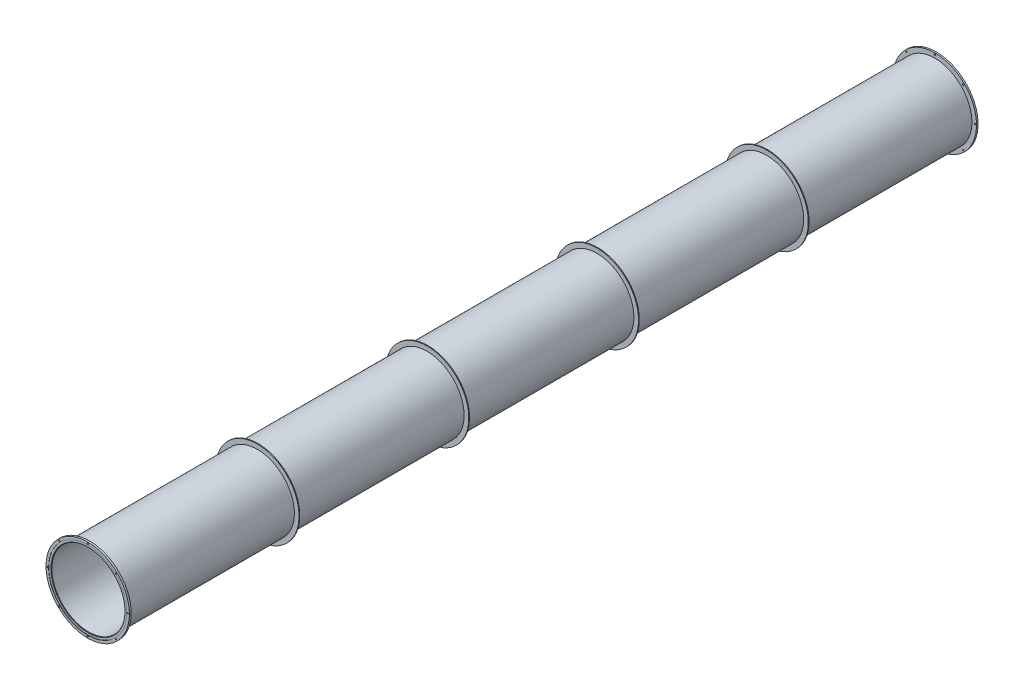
ISO-10303-21;
HEADER;
FILE_DESCRIPTION(('STEP AP214'),'2;1');
FILE_NAME('part.step','',(''),(''),'','','');
FILE_SCHEMA(('AUTOMOTIVE_DESIGN { 1 0 10303 214 1 1 1 1 }'));
ENDSEC;
DATA;
#1=APPLICATION_CONTEXT('core data for automotive mechanical design processes');
#2=APPLICATION_PROTOCOL_DEFINITION('international standard','automotive_design',2000,#1);
#3=PRODUCT_CONTEXT('',#1,'mechanical');
#4=PRODUCT('Part','Part','',(#3));
#5=PRODUCT_RELATED_PRODUCT_CATEGORY('part','',(#4));
#6=PRODUCT_DEFINITION_FORMATION('','',#4);
#7=PRODUCT_DEFINITION_CONTEXT('part definition',#1,'design');
#8=PRODUCT_DEFINITION('design','',#6,#7);
#9=PRODUCT_DEFINITION_SHAPE('','',#8);
#10=(LENGTH_UNIT() NAMED_UNIT(*) SI_UNIT(.MILLI.,.METRE.));
#11=(NAMED_UNIT(*) PLANE_ANGLE_UNIT() SI_UNIT($,.RADIAN.));
#12=(NAMED_UNIT(*) SI_UNIT($,.STERADIAN.) SOLID_ANGLE_UNIT());
#13=UNCERTAINTY_MEASURE_WITH_UNIT(LENGTH_MEASURE(1.E-05),#10,'distance_accuracy_value','');
#14=(GEOMETRIC_REPRESENTATION_CONTEXT(3) GLOBAL_UNCERTAINTY_ASSIGNED_CONTEXT((#13)) GLOBAL_UNIT_ASSIGNED_CONTEXT((#10,
#11,#12)) REPRESENTATION_CONTEXT('',''));
#15=CARTESIAN_POINT('',(0.,0.,0.));
#16=DIRECTION('',(0.,0.,1.));
#17=DIRECTION('',(1.,0.,0.));
#18=AXIS2_PLACEMENT_3D('',#15,#16,#17);
#19=CARTESIAN_POINT('',(685.8,0.,-6978.65));
#20=DIRECTION('',(0.,0.,1.));
#21=DIRECTION('',(1.,0.,0.));
#22=AXIS2_PLACEMENT_3D('',#19,#20,#21);
#23=PLANE('',#22);
#24=CARTESIAN_POINT('',(-466.973318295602,466.97331829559,-6978.65));
#25=DIRECTION('',(0.,0.,-1.));
#26=DIRECTION('',(-1.,0.,0.));
#27=AXIS2_PLACEMENT_3D('',#24,#25,#26);
#28=CIRCLE('',#27,11.1125);
#29=CARTESIAN_POINT('',(-478.085818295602,466.97331829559,-6978.65));
#30=VERTEX_POINT('',#29);
#31=EDGE_CURVE('E239',#30,#30,#28,.T.);
#32=ORIENTED_EDGE('',*,*,#31,.F.);
#33=EDGE_LOOP('',(#32));
#34=FACE_BOUND('',#33,.T.);
#35=CARTESIAN_POINT('',(-6.91732282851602E-12,660.4,-6978.65));
#36=DIRECTION('',(0.,0.,-1.));
#37=DIRECTION('',(-1.,0.,0.));
#38=AXIS2_PLACEMENT_3D('',#35,#36,#37);
#39=CIRCLE('',#38,11.1125);
#40=CARTESIAN_POINT('',(-11.1125000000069,660.4,-6978.65));
#41=VERTEX_POINT('',#40);
#42=EDGE_CURVE('E233',#41,#41,#39,.T.);
#43=ORIENTED_EDGE('',*,*,#42,.F.);
#44=EDGE_LOOP('',(#43));
#45=FACE_BOUND('',#44,.T.);
#46=CARTESIAN_POINT('',(466.973318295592,466.9733182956,-6978.65));
#47=DIRECTION('',(0.,0.,-1.));
#48=DIRECTION('',(-1.,0.,0.));
#49=AXIS2_PLACEMENT_3D('',#46,#47,#48);
#50=CIRCLE('',#49,11.1125);
#51=CARTESIAN_POINT('',(455.860818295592,466.9733182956,-6978.65));
#52=VERTEX_POINT('',#51);
#53=EDGE_CURVE('E227',#52,#52,#50,.T.);
#54=ORIENTED_EDGE('',*,*,#53,.F.);
#55=EDGE_LOOP('',(#54));
#56=FACE_BOUND('',#55,.T.);
#57=CARTESIAN_POINT('',(660.4,0.,-6978.65));
#58=DIRECTION('',(0.,0.,-1.));
#59=DIRECTION('',(-1.,0.,0.));
#60=AXIS2_PLACEMENT_3D('',#57,#58,#59);
#61=CIRCLE('',#60,11.1125);
#62=CARTESIAN_POINT('',(649.2875,0.,-6978.65));
#63=VERTEX_POINT('',#62);
#64=EDGE_CURVE('E221',#63,#63,#61,.T.);
#65=ORIENTED_EDGE('',*,*,#64,.F.);
#66=EDGE_LOOP('',(#65));
#67=FACE_BOUND('',#66,.T.);
#68=CARTESIAN_POINT('',(466.973318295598,-466.973318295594,-6978.65));
#69=DIRECTION('',(0.,0.,-1.));
#70=DIRECTION('',(-1.,0.,0.));
#71=AXIS2_PLACEMENT_3D('',#68,#69,#70);
#72=CIRCLE('',#71,11.1125);
#73=CARTESIAN_POINT('',(455.860818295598,-466.973318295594,-6978.65));
#74=VERTEX_POINT('',#73);
#75=EDGE_CURVE('E215',#74,#74,#72,.T.);
#76=ORIENTED_EDGE('',*,*,#75,.F.);
#77=EDGE_LOOP('',(#76));
#78=FACE_BOUND('',#77,.T.);
#79=CARTESIAN_POINT('',(2.30577427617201E-12,-660.4,-6978.65));
#80=DIRECTION('',(0.,0.,-1.));
#81=DIRECTION('',(-1.,0.,0.));
#82=AXIS2_PLACEMENT_3D('',#79,#80,#81);
#83=CIRCLE('',#82,11.1125);
#84=CARTESIAN_POINT('',(-11.1124999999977,-660.4,-6978.65));
#85=VERTEX_POINT('',#84);
#86=EDGE_CURVE('E209',#85,#85,#83,.T.);
#87=ORIENTED_EDGE('',*,*,#86,.F.);
#88=EDGE_LOOP('',(#87));
#89=FACE_BOUND('',#88,.T.);
#90=CARTESIAN_POINT('',(-466.973318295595,-466.973318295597,-6978.65));
#91=DIRECTION('',(0.,0.,-1.));
#92=DIRECTION('',(-1.,0.,0.));
#93=AXIS2_PLACEMENT_3D('',#90,#91,#92);
#94=CIRCLE('',#93,11.1125);
#95=CARTESIAN_POINT('',(-478.085818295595,-466.973318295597,-6978.65));
#96=VERTEX_POINT('',#95);
#97=EDGE_CURVE('E203',#96,#96,#94,.T.);
#98=ORIENTED_EDGE('',*,*,#97,.F.);
#99=EDGE_LOOP('',(#98));
#100=FACE_BOUND('',#99,.T.);
#101=CARTESIAN_POINT('',(0.,0.,-6978.65));
#102=DIRECTION('',(0.,0.,-1.));
#103=DIRECTION('',(-1.,0.,0.));
#104=AXIS2_PLACEMENT_3D('',#101,#102,#103);
#105=CIRCLE('',#104,685.8);
#106=CARTESIAN_POINT('',(-685.8,0.,-6978.65));
#107=VERTEX_POINT('',#106);
#108=EDGE_CURVE('E113',#107,#107,#105,.T.);
#109=ORIENTED_EDGE('',*,*,#108,.T.);
#110=EDGE_LOOP('',(#109));
#111=FACE_BOUND('',#110,.T.);
#112=CARTESIAN_POINT('',(0.,0.,-6978.65));
#113=DIRECTION('',(0.,0.,-1.));
#114=DIRECTION('',(-1.,0.,0.));
#115=AXIS2_PLACEMENT_3D('',#112,#113,#114);
#116=CIRCLE('',#115,641.35);
#117=CARTESIAN_POINT('',(-641.35,0.,-6978.65));
#118=VERTEX_POINT('',#117);
#119=EDGE_CURVE('E116',#118,#118,#116,.T.);
#120=ORIENTED_EDGE('',*,*,#119,.F.);
#121=EDGE_LOOP('',(#120));
#122=FACE_BOUND('',#121,.T.);
#123=CARTESIAN_POINT('',(-660.4,0.,-6978.65));
#124=DIRECTION('',(0.,0.,-1.));
#125=DIRECTION('',(-1.,0.,0.));
#126=AXIS2_PLACEMENT_3D('',#123,#124,#125);
#127=CIRCLE('',#126,11.1125);
#128=CARTESIAN_POINT('',(-671.5125,0.,-6978.65));
#129=VERTEX_POINT('',#128);
#130=EDGE_CURVE('E197',#129,#129,#127,.T.);
#131=ORIENTED_EDGE('',*,*,#130,.F.);
#132=EDGE_LOOP('',(#131));
#133=FACE_BOUND('',#132,.T.);
#134=ADVANCED_FACE('F30',(#34,#45,#56,#67,#78,#89,#100,#111,#122,#133),#23,.F.);
#135=CARTESIAN_POINT('',(685.800000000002,0.,6989.7625));
#136=DIRECTION('',(0.,0.,-1.));
#137=DIRECTION('',(-1.,0.,0.));
#138=AXIS2_PLACEMENT_3D('',#135,#136,#137);
#139=PLANE('',#138);
#140=CARTESIAN_POINT('',(-6.99819850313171E-12,660.4,6989.7625));
#141=DIRECTION('',(0.,0.,1.));
#142=DIRECTION('',(1.,0.,0.));
#143=AXIS2_PLACEMENT_3D('',#140,#141,#142);
#144=CIRCLE('',#143,11.1125);
#145=CARTESIAN_POINT('',(11.112499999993,660.4,6989.7625));
#146=VERTEX_POINT('',#145);
#147=EDGE_CURVE('E185',#146,#146,#144,.T.);
#148=ORIENTED_EDGE('',*,*,#147,.F.);
#149=EDGE_LOOP('',(#148));
#150=FACE_BOUND('',#149,.T.);
#151=CARTESIAN_POINT('',(-466.973318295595,-466.973318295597,6989.7625));
#152=DIRECTION('',(0.,0.,1.));
#153=DIRECTION('',(1.,0.,0.));
#154=AXIS2_PLACEMENT_3D('',#151,#152,#153);
#155=CIRCLE('',#154,11.1125);
#156=CARTESIAN_POINT('',(-455.860818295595,-466.973318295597,6989.7625));
#157=VERTEX_POINT('',#156);
#158=EDGE_CURVE('E155',#157,#157,#155,.T.);
#159=ORIENTED_EDGE('',*,*,#158,.F.);
#160=EDGE_LOOP('',(#159));
#161=FACE_BOUND('',#160,.T.);
#162=CARTESIAN_POINT('',(-660.4,0.,6989.7625));
#163=DIRECTION('',(0.,0.,1.));
#164=DIRECTION('',(1.,0.,0.));
#165=AXIS2_PLACEMENT_3D('',#162,#163,#164);
#166=CIRCLE('',#165,11.1125);
#167=CARTESIAN_POINT('',(-649.2875,0.,6989.7625));
#168=VERTEX_POINT('',#167);
#169=EDGE_CURVE('E149',#168,#168,#166,.T.);
#170=ORIENTED_EDGE('',*,*,#169,.F.);
#171=EDGE_LOOP('',(#170));
#172=FACE_BOUND('',#171,.T.);
#173=CARTESIAN_POINT('',(0.,0.,6989.7625));
#174=DIRECTION('',(0.,0.,-1.));
#175=DIRECTION('',(-1.,0.,0.));
#176=AXIS2_PLACEMENT_3D('',#173,#174,#175);
#177=CIRCLE('',#176,685.800000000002);
#178=CARTESIAN_POINT('',(-685.800000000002,0.,6989.7625));
#179=VERTEX_POINT('',#178);
#180=EDGE_CURVE('E50',#179,#179,#177,.T.);
#181=ORIENTED_EDGE('',*,*,#180,.F.);
#182=EDGE_LOOP('',(#181));
#183=FACE_BOUND('',#182,.T.);
#184=CARTESIAN_POINT('',(0.,0.,6989.7625));
#185=DIRECTION('',(0.,0.,-1.));
#186=DIRECTION('',(-1.,0.,0.));
#187=AXIS2_PLACEMENT_3D('',#184,#185,#186);
#188=CIRCLE('',#187,642.937500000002);
#189=CARTESIAN_POINT('',(-642.937500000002,0.,6989.7625));
#190=VERTEX_POINT('',#189);
#191=EDGE_CURVE('E45',#190,#190,#188,.T.);
#192=ORIENTED_EDGE('',*,*,#191,.T.);
#193=EDGE_LOOP('',(#192));
#194=FACE_BOUND('',#193,.T.);
#195=CARTESIAN_POINT('',(2.3866499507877E-12,-660.4,6989.7625));
#196=DIRECTION('',(0.,0.,1.));
#197=DIRECTION('',(1.,0.,0.));
#198=AXIS2_PLACEMENT_3D('',#195,#196,#197);
#199=CIRCLE('',#198,11.1125);
#200=CARTESIAN_POINT('',(11.1125000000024,-660.4,6989.7625));
#201=VERTEX_POINT('',#200);
#202=EDGE_CURVE('E161',#201,#201,#199,.T.);
#203=ORIENTED_EDGE('',*,*,#202,.F.);
#204=EDGE_LOOP('',(#203));
#205=FACE_BOUND('',#204,.T.);
#206=CARTESIAN_POINT('',(466.973318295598,-466.973318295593,6989.7625));
#207=DIRECTION('',(0.,0.,1.));
#208=DIRECTION('',(1.,0.,0.));
#209=AXIS2_PLACEMENT_3D('',#206,#207,#208);
#210=CIRCLE('',#209,11.1125);
#211=CARTESIAN_POINT('',(478.085818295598,-466.973318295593,6989.7625));
#212=VERTEX_POINT('',#211);
#213=EDGE_CURVE('E167',#212,#212,#210,.T.);
#214=ORIENTED_EDGE('',*,*,#213,.F.);
#215=EDGE_LOOP('',(#214));
#216=FACE_BOUND('',#215,.T.);
#217=CARTESIAN_POINT('',(660.4,0.,6989.7625));
#218=DIRECTION('',(0.,0.,1.));
#219=DIRECTION('',(1.,0.,0.));
#220=AXIS2_PLACEMENT_3D('',#217,#218,#219);
#221=CIRCLE('',#220,11.1125);
#222=CARTESIAN_POINT('',(671.5125,0.,6989.7625));
#223=VERTEX_POINT('',#222);
#224=EDGE_CURVE('E173',#223,#223,#221,.T.);
#225=ORIENTED_EDGE('',*,*,#224,.F.);
#226=EDGE_LOOP('',(#225));
#227=FACE_BOUND('',#226,.T.);
#228=CARTESIAN_POINT('',(466.973318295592,466.9733182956,6989.7625));
#229=DIRECTION('',(0.,0.,1.));
#230=DIRECTION('',(1.,0.,0.));
#231=AXIS2_PLACEMENT_3D('',#228,#229,#230);
#232=CIRCLE('',#231,11.1125);
#233=CARTESIAN_POINT('',(478.085818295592,466.9733182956,6989.7625));
#234=VERTEX_POINT('',#233);
#235=EDGE_CURVE('E179',#234,#234,#232,.T.);
#236=ORIENTED_EDGE('',*,*,#235,.F.);
#237=EDGE_LOOP('',(#236));
#238=FACE_BOUND('',#237,.T.);
#239=CARTESIAN_POINT('',(-466.973318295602,466.97331829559,6989.7625));
#240=DIRECTION('',(0.,0.,1.));
#241=DIRECTION('',(1.,0.,0.));
#242=AXIS2_PLACEMENT_3D('',#239,#240,#241);
#243=CIRCLE('',#242,11.1125);
#244=CARTESIAN_POINT('',(-455.860818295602,466.97331829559,6989.7625));
#245=VERTEX_POINT('',#244);
#246=EDGE_CURVE('E191',#245,#245,#243,.T.);
#247=ORIENTED_EDGE('',*,*,#246,.F.);
#248=EDGE_LOOP('',(#247));
#249=FACE_BOUND('',#248,.T.);
#250=ADVANCED_FACE('F247',(#150,#161,#172,#183,#194,#205,#216,#227,#238,#249),#139,.F.);
#251=CARTESIAN_POINT('',(0.,0.,6975.475));
#252=DIRECTION('',(0.,0.,1.));
#253=DIRECTION('',(1.,0.,0.));
#254=AXIS2_PLACEMENT_3D('',#251,#252,#253);
#255=CONICAL_SURFACE('',#254,603.25,0.785398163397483);
#256=CARTESIAN_POINT('',(0.,0.,6981.825));
#257=DIRECTION('',(0.,0.,-1.));
#258=DIRECTION('',(-1.,0.,0.));
#259=AXIS2_PLACEMENT_3D('',#256,#257,#258);
#260=CIRCLE('',#259,609.600000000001);
#261=CARTESIAN_POINT('',(-609.600000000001,0.,6981.825));
#262=VERTEX_POINT('',#261);
#263=EDGE_CURVE('E10',#262,#262,#260,.T.);
#264=ORIENTED_EDGE('',*,*,#263,.F.);
#265=EDGE_LOOP('',(#264));
#266=FACE_BOUND('',#265,.T.);
#267=CARTESIAN_POINT('',(0.,0.,6975.475));
#268=DIRECTION('',(0.,0.,-1.));
#269=DIRECTION('',(-1.,0.,0.));
#270=AXIS2_PLACEMENT_3D('',#267,#268,#269);
#271=CIRCLE('',#270,603.25);
#272=CARTESIAN_POINT('',(-603.25,0.,6975.475));
#273=VERTEX_POINT('',#272);
#274=EDGE_CURVE('E143',#273,#273,#271,.T.);
#275=ORIENTED_EDGE('',*,*,#274,.T.);
#276=EDGE_LOOP('',(#275));
#277=FACE_BOUND('',#276,.T.);
#278=ADVANCED_FACE('F32',(#266,#277),#255,.F.);
#279=CARTESIAN_POINT('',(0.,0.,-88.99));
#280=DIRECTION('',(0.,0.,-1.));
#281=DIRECTION('',(-1.,0.,0.));
#282=AXIS2_PLACEMENT_3D('',#279,#280,#281);
#283=CYLINDRICAL_SURFACE('',#282,609.600000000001);
#284=CARTESIAN_POINT('',(0.,0.,6985.));
#285=DIRECTION('',(0.,0.,-1.));
#286=DIRECTION('',(-1.,0.,0.));
#287=AXIS2_PLACEMENT_3D('',#284,#285,#286);
#288=CIRCLE('',#287,609.600000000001);
#289=CARTESIAN_POINT('',(-609.600000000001,0.,6985.));
#290=VERTEX_POINT('',#289);
#291=EDGE_CURVE('E37',#290,#290,#288,.T.);
#292=ORIENTED_EDGE('',*,*,#291,.F.);
#293=EDGE_LOOP('',(#292));
#294=FACE_BOUND('',#293,.T.);
#295=ORIENTED_EDGE('',*,*,#263,.T.);
#296=EDGE_LOOP('',(#295));
#297=FACE_BOUND('',#296,.T.);
#298=ADVANCED_FACE('F442',(#294,#297),#283,.F.);
#299=CARTESIAN_POINT('',(642.937500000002,0.,6985.));
#300=DIRECTION('',(0.,0.,-1.));
#301=DIRECTION('',(-1.,0.,0.));
#302=AXIS2_PLACEMENT_3D('',#299,#300,#301);
#303=PLANE('',#302);
#304=CARTESIAN_POINT('',(0.,0.,6985.));
#305=DIRECTION('',(0.,0.,-1.));
#306=DIRECTION('',(-1.,0.,0.));
#307=AXIS2_PLACEMENT_3D('',#304,#305,#306);
#308=CIRCLE('',#307,642.937500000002);
#309=CARTESIAN_POINT('',(-642.937500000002,0.,6985.));
#310=VERTEX_POINT('',#309);
#311=EDGE_CURVE('E41',#310,#310,#308,.T.);
#312=ORIENTED_EDGE('',*,*,#311,.F.);
#313=EDGE_LOOP('',(#312));
#314=FACE_BOUND('',#313,.T.);
#315=ORIENTED_EDGE('',*,*,#291,.T.);
#316=EDGE_LOOP('',(#315));
#317=FACE_BOUND('',#316,.T.);
#318=ADVANCED_FACE('F439',(#314,#317),#303,.F.);
#319=CARTESIAN_POINT('',(0.,0.,-88.99));
#320=DIRECTION('',(0.,0.,-1.));
#321=DIRECTION('',(-1.,0.,0.));
#322=AXIS2_PLACEMENT_3D('',#319,#320,#321);
#323=CYLINDRICAL_SURFACE('',#322,642.937500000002);
#324=ORIENTED_EDGE('',*,*,#191,.F.);
#325=EDGE_LOOP('',(#324));
#326=FACE_BOUND('',#325,.T.);
#327=ORIENTED_EDGE('',*,*,#311,.T.);
#328=EDGE_LOOP('',(#327));
#329=FACE_BOUND('',#328,.T.);
#330=ADVANCED_FACE('F432',(#326,#329),#323,.F.);
#331=CARTESIAN_POINT('',(0.,0.,-88.99));
#332=DIRECTION('',(0.,0.,-1.));
#333=DIRECTION('',(-1.,0.,0.));
#334=AXIS2_PLACEMENT_3D('',#331,#332,#333);
#335=CYLINDRICAL_SURFACE('',#334,685.800000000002);
#336=CARTESIAN_POINT('',(0.,0.,6959.6));
#337=DIRECTION('',(0.,0.,-1.));
#338=DIRECTION('',(-1.,0.,0.));
#339=AXIS2_PLACEMENT_3D('',#336,#337,#338);
#340=CIRCLE('',#339,685.800000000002);
#341=CARTESIAN_POINT('',(-685.800000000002,0.,6959.6));
#342=VERTEX_POINT('',#341);
#343=EDGE_CURVE('E53',#342,#342,#340,.T.);
#344=ORIENTED_EDGE('',*,*,#343,.F.);
#345=EDGE_LOOP('',(#344));
#346=FACE_BOUND('',#345,.T.);
#347=ORIENTED_EDGE('',*,*,#180,.T.);
#348=EDGE_LOOP('',(#347));
#349=FACE_BOUND('',#348,.T.);
#350=ADVANCED_FACE('F428',(#346,#349),#335,.T.);
#351=CARTESIAN_POINT('',(609.6,0.,6959.6));
#352=DIRECTION('',(0.,0.,1.));
#353=DIRECTION('',(1.,0.,0.));
#354=AXIS2_PLACEMENT_3D('',#351,#352,#353);
#355=PLANE('',#354);
#356=CARTESIAN_POINT('',(-466.973318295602,466.97331829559,6959.6));
#357=DIRECTION('',(0.,0.,1.));
#358=DIRECTION('',(1.,0.,0.));
#359=AXIS2_PLACEMENT_3D('',#356,#357,#358);
#360=CIRCLE('',#359,11.1124999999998);
#361=CARTESIAN_POINT('',(-455.860818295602,466.97331829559,6959.6));
#362=VERTEX_POINT('',#361);
#363=EDGE_CURVE('E188',#362,#362,#360,.T.);
#364=ORIENTED_EDGE('',*,*,#363,.T.);
#365=EDGE_LOOP('',(#364));
#366=FACE_BOUND('',#365,.T.);
#367=CARTESIAN_POINT('',(-6.99819850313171E-12,660.4,6959.6));
#368=DIRECTION('',(0.,0.,1.));
#369=DIRECTION('',(1.,0.,0.));
#370=AXIS2_PLACEMENT_3D('',#367,#368,#369);
#371=CIRCLE('',#370,11.1124999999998);
#372=CARTESIAN_POINT('',(11.1124999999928,660.4,6959.6));
#373=VERTEX_POINT('',#372);
#374=EDGE_CURVE('E182',#373,#373,#371,.T.);
#375=ORIENTED_EDGE('',*,*,#374,.T.);
#376=EDGE_LOOP('',(#375));
#377=FACE_BOUND('',#376,.T.);
#378=CARTESIAN_POINT('',(466.973318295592,466.9733182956,6959.6));
#379=DIRECTION('',(0.,0.,1.));
#380=DIRECTION('',(1.,0.,0.));
#381=AXIS2_PLACEMENT_3D('',#378,#379,#380);
#382=CIRCLE('',#381,11.1124999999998);
#383=CARTESIAN_POINT('',(478.085818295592,466.9733182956,6959.6));
#384=VERTEX_POINT('',#383);
#385=EDGE_CURVE('E176',#384,#384,#382,.T.);
#386=ORIENTED_EDGE('',*,*,#385,.T.);
#387=EDGE_LOOP('',(#386));
#388=FACE_BOUND('',#387,.T.);
#389=CARTESIAN_POINT('',(660.4,0.,6959.6));
#390=DIRECTION('',(0.,0.,1.));
#391=DIRECTION('',(1.,0.,0.));
#392=AXIS2_PLACEMENT_3D('',#389,#390,#391);
#393=CIRCLE('',#392,11.1124999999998);
#394=CARTESIAN_POINT('',(671.5125,0.,6959.6));
#395=VERTEX_POINT('',#394);
#396=EDGE_CURVE('E170',#395,#395,#393,.T.);
#397=ORIENTED_EDGE('',*,*,#396,.T.);
#398=EDGE_LOOP('',(#397));
#399=FACE_BOUND('',#398,.T.);
#400=CARTESIAN_POINT('',(466.973318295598,-466.973318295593,6959.6));
#401=DIRECTION('',(0.,0.,1.));
#402=DIRECTION('',(1.,0.,0.));
#403=AXIS2_PLACEMENT_3D('',#400,#401,#402);
#404=CIRCLE('',#403,11.1124999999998);
#405=CARTESIAN_POINT('',(478.085818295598,-466.973318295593,6959.6));
#406=VERTEX_POINT('',#405);
#407=EDGE_CURVE('E164',#406,#406,#404,.T.);
#408=ORIENTED_EDGE('',*,*,#407,.T.);
#409=EDGE_LOOP('',(#408));
#410=FACE_BOUND('',#409,.T.);
#411=CARTESIAN_POINT('',(2.3866499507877E-12,-660.4,6959.6));
#412=DIRECTION('',(0.,0.,1.));
#413=DIRECTION('',(1.,0.,0.));
#414=AXIS2_PLACEMENT_3D('',#411,#412,#413);
#415=CIRCLE('',#414,11.1124999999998);
#416=CARTESIAN_POINT('',(11.1125000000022,-660.4,6959.6));
#417=VERTEX_POINT('',#416);
#418=EDGE_CURVE('E158',#417,#417,#415,.T.);
#419=ORIENTED_EDGE('',*,*,#418,.T.);
#420=EDGE_LOOP('',(#419));
#421=FACE_BOUND('',#420,.T.);
#422=CARTESIAN_POINT('',(-466.973318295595,-466.973318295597,6959.6));
#423=DIRECTION('',(0.,0.,1.));
#424=DIRECTION('',(1.,0.,0.));
#425=AXIS2_PLACEMENT_3D('',#422,#423,#424);
#426=CIRCLE('',#425,11.1125);
#427=CARTESIAN_POINT('',(-455.860818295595,-466.973318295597,6959.6));
#428=VERTEX_POINT('',#427);
#429=EDGE_CURVE('E152',#428,#428,#426,.T.);
#430=ORIENTED_EDGE('',*,*,#429,.T.);
#431=EDGE_LOOP('',(#430));
#432=FACE_BOUND('',#431,.T.);
#433=CARTESIAN_POINT('',(-660.4,0.,6959.6));
#434=DIRECTION('',(0.,0.,1.));
#435=DIRECTION('',(1.,0.,0.));
#436=AXIS2_PLACEMENT_3D('',#433,#434,#435);
#437=CIRCLE('',#436,11.1125);
#438=CARTESIAN_POINT('',(-649.2875,0.,6959.6));
#439=VERTEX_POINT('',#438);
#440=EDGE_CURVE('E146',#439,#439,#437,.T.);
#441=ORIENTED_EDGE('',*,*,#440,.T.);
#442=EDGE_LOOP('',(#441));
#443=FACE_BOUND('',#442,.T.);
#444=CARTESIAN_POINT('',(0.,0.,6959.6));
#445=DIRECTION('',(0.,0.,-1.));
#446=DIRECTION('',(-1.,0.,0.));
#447=AXIS2_PLACEMENT_3D('',#444,#445,#446);
#448=CIRCLE('',#447,609.6);
#449=CARTESIAN_POINT('',(-609.6,0.,6959.6));
#450=VERTEX_POINT('',#449);
#451=EDGE_CURVE('E56',#450,#450,#448,.T.);
#452=ORIENTED_EDGE('',*,*,#451,.F.);
#453=EDGE_LOOP('',(#452));
#454=FACE_BOUND('',#453,.T.);
#455=ORIENTED_EDGE('',*,*,#343,.T.);
#456=EDGE_LOOP('',(#455));
#457=FACE_BOUND('',#456,.T.);
#458=ADVANCED_FACE('F424',(#366,#377,#388,#399,#410,#421,#432,#443,#454,#457),#355,.F.);
#459=CARTESIAN_POINT('',(0.,0.,-88.99));
#460=DIRECTION('',(0.,0.,-1.));
#461=DIRECTION('',(-1.,0.,0.));
#462=AXIS2_PLACEMENT_3D('',#459,#460,#461);
#463=CYLINDRICAL_SURFACE('',#462,609.6);
#464=CARTESIAN_POINT('',(0.,0.,4197.35));
#465=DIRECTION('',(0.,0.,-1.));
#466=DIRECTION('',(-1.,0.,0.));
#467=AXIS2_PLACEMENT_3D('',#464,#465,#466);
#468=CIRCLE('',#467,609.6);
#469=CARTESIAN_POINT('',(-609.6,0.,4197.35));
#470=VERTEX_POINT('',#469);
#471=EDGE_CURVE('E59',#470,#470,#468,.T.);
#472=ORIENTED_EDGE('',*,*,#471,.F.);
#473=EDGE_LOOP('',(#472));
#474=FACE_BOUND('',#473,.T.);
#475=ORIENTED_EDGE('',*,*,#451,.T.);
#476=EDGE_LOOP('',(#475));
#477=FACE_BOUND('',#476,.T.);
#478=ADVANCED_FACE('F420',(#474,#477),#463,.T.);
#479=CARTESIAN_POINT('',(685.8,0.,4197.35));
#480=DIRECTION('',(0.,0.,-1.));
#481=DIRECTION('',(-1.,0.,0.));
#482=AXIS2_PLACEMENT_3D('',#479,#480,#481);
#483=PLANE('',#482);
#484=CARTESIAN_POINT('',(0.,0.,4197.35));
#485=DIRECTION('',(0.,0.,-1.));
#486=DIRECTION('',(-1.,0.,0.));
#487=AXIS2_PLACEMENT_3D('',#484,#485,#486);
#488=CIRCLE('',#487,685.8);
#489=CARTESIAN_POINT('',(-685.8,0.,4197.35));
#490=VERTEX_POINT('',#489);
#491=EDGE_CURVE('E62',#490,#490,#488,.T.);
#492=ORIENTED_EDGE('',*,*,#491,.F.);
#493=EDGE_LOOP('',(#492));
#494=FACE_BOUND('',#493,.T.);
#495=ORIENTED_EDGE('',*,*,#471,.T.);
#496=EDGE_LOOP('',(#495));
#497=FACE_BOUND('',#496,.T.);
#498=ADVANCED_FACE('F416',(#494,#497),#483,.F.);
#499=CARTESIAN_POINT('',(0.,0.,-88.99));
#500=DIRECTION('',(0.,0.,-1.));
#501=DIRECTION('',(-1.,0.,0.));
#502=AXIS2_PLACEMENT_3D('',#499,#500,#501);
#503=CYLINDRICAL_SURFACE('',#502,685.8);
#504=CARTESIAN_POINT('',(0.,0.,4184.65));
#505=DIRECTION('',(0.,0.,-1.));
#506=DIRECTION('',(-1.,0.,0.));
#507=AXIS2_PLACEMENT_3D('',#504,#505,#506);
#508=CIRCLE('',#507,685.8);
#509=CARTESIAN_POINT('',(-685.8,0.,4184.65));
#510=VERTEX_POINT('',#509);
#511=EDGE_CURVE('E65',#510,#510,#508,.T.);
#512=ORIENTED_EDGE('',*,*,#511,.F.);
#513=EDGE_LOOP('',(#512));
#514=FACE_BOUND('',#513,.T.);
#515=ORIENTED_EDGE('',*,*,#491,.T.);
#516=EDGE_LOOP('',(#515));
#517=FACE_BOUND('',#516,.T.);
#518=ADVANCED_FACE('F412',(#514,#517),#503,.T.);
#519=CARTESIAN_POINT('',(609.6,0.,4184.65));
#520=DIRECTION('',(0.,0.,1.));
#521=DIRECTION('',(1.,0.,0.));
#522=AXIS2_PLACEMENT_3D('',#519,#520,#521);
#523=PLANE('',#522);
#524=CARTESIAN_POINT('',(0.,0.,4184.65));
#525=DIRECTION('',(0.,0.,-1.));
#526=DIRECTION('',(-1.,0.,0.));
#527=AXIS2_PLACEMENT_3D('',#524,#525,#526);
#528=CIRCLE('',#527,609.6);
#529=CARTESIAN_POINT('',(-609.6,0.,4184.65));
#530=VERTEX_POINT('',#529);
#531=EDGE_CURVE('E68',#530,#530,#528,.T.);
#532=ORIENTED_EDGE('',*,*,#531,.F.);
#533=EDGE_LOOP('',(#532));
#534=FACE_BOUND('',#533,.T.);
#535=ORIENTED_EDGE('',*,*,#511,.T.);
#536=EDGE_LOOP('',(#535));
#537=FACE_BOUND('',#536,.T.);
#538=ADVANCED_FACE('F408',(#534,#537),#523,.F.);
#539=CARTESIAN_POINT('',(0.,0.,-88.99));
#540=DIRECTION('',(0.,0.,-1.));
#541=DIRECTION('',(-1.,0.,0.));
#542=AXIS2_PLACEMENT_3D('',#539,#540,#541);
#543=CYLINDRICAL_SURFACE('',#542,609.599999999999);
#544=CARTESIAN_POINT('',(0.,0.,1403.35));
#545=DIRECTION('',(0.,0.,-1.));
#546=DIRECTION('',(-1.,0.,0.));
#547=AXIS2_PLACEMENT_3D('',#544,#545,#546);
#548=CIRCLE('',#547,609.599999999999);
#549=CARTESIAN_POINT('',(-609.599999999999,0.,1403.35));
#550=VERTEX_POINT('',#549);
#551=EDGE_CURVE('E71',#550,#550,#548,.T.);
#552=ORIENTED_EDGE('',*,*,#551,.F.);
#553=EDGE_LOOP('',(#552));
#554=FACE_BOUND('',#553,.T.);
#555=ORIENTED_EDGE('',*,*,#531,.T.);
#556=EDGE_LOOP('',(#555));
#557=FACE_BOUND('',#556,.T.);
#558=ADVANCED_FACE('F404',(#554,#557),#543,.T.);
#559=CARTESIAN_POINT('',(685.799999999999,0.,1403.35));
#560=DIRECTION('',(0.,0.,-1.));
#561=DIRECTION('',(-1.,0.,0.));
#562=AXIS2_PLACEMENT_3D('',#559,#560,#561);
#563=PLANE('',#562);
#564=CARTESIAN_POINT('',(0.,0.,1403.35));
#565=DIRECTION('',(0.,0.,-1.));
#566=DIRECTION('',(-1.,0.,0.));
#567=AXIS2_PLACEMENT_3D('',#564,#565,#566);
#568=CIRCLE('',#567,685.799999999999);
#569=CARTESIAN_POINT('',(-685.799999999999,0.,1403.35));
#570=VERTEX_POINT('',#569);
#571=EDGE_CURVE('E74',#570,#570,#568,.T.);
#572=ORIENTED_EDGE('',*,*,#571,.F.);
#573=EDGE_LOOP('',(#572));
#574=FACE_BOUND('',#573,.T.);
#575=ORIENTED_EDGE('',*,*,#551,.T.);
#576=EDGE_LOOP('',(#575));
#577=FACE_BOUND('',#576,.T.);
#578=ADVANCED_FACE('F400',(#574,#577),#563,.F.);
#579=CARTESIAN_POINT('',(0.,0.,-88.99));
#580=DIRECTION('',(0.,0.,-1.));
#581=DIRECTION('',(-1.,0.,0.));
#582=AXIS2_PLACEMENT_3D('',#579,#580,#581);
#583=CYLINDRICAL_SURFACE('',#582,685.799999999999);
#584=CARTESIAN_POINT('',(0.,0.,1390.65));
#585=DIRECTION('',(0.,0.,-1.));
#586=DIRECTION('',(-1.,0.,0.));
#587=AXIS2_PLACEMENT_3D('',#584,#585,#586);
#588=CIRCLE('',#587,685.799999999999);
#589=CARTESIAN_POINT('',(-685.799999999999,0.,1390.65));
#590=VERTEX_POINT('',#589);
#591=EDGE_CURVE('E77',#590,#590,#588,.T.);
#592=ORIENTED_EDGE('',*,*,#591,.F.);
#593=EDGE_LOOP('',(#592));
#594=FACE_BOUND('',#593,.T.);
#595=ORIENTED_EDGE('',*,*,#571,.T.);
#596=EDGE_LOOP('',(#595));
#597=FACE_BOUND('',#596,.T.);
#598=ADVANCED_FACE('F396',(#594,#597),#583,.T.);
#599=CARTESIAN_POINT('',(609.599999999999,0.,1390.65));
#600=DIRECTION('',(0.,0.,1.));
#601=DIRECTION('',(1.,0.,0.));
#602=AXIS2_PLACEMENT_3D('',#599,#600,#601);
#603=PLANE('',#602);
#604=CARTESIAN_POINT('',(0.,0.,1390.65));
#605=DIRECTION('',(0.,0.,-1.));
#606=DIRECTION('',(-1.,0.,0.));
#607=AXIS2_PLACEMENT_3D('',#604,#605,#606);
#608=CIRCLE('',#607,609.599999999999);
#609=CARTESIAN_POINT('',(-609.599999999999,0.,1390.65));
#610=VERTEX_POINT('',#609);
#611=EDGE_CURVE('E80',#610,#610,#608,.T.);
#612=ORIENTED_EDGE('',*,*,#611,.F.);
#613=EDGE_LOOP('',(#612));
#614=FACE_BOUND('',#613,.T.);
#615=ORIENTED_EDGE('',*,*,#591,.T.);
#616=EDGE_LOOP('',(#615));
#617=FACE_BOUND('',#616,.T.);
#618=ADVANCED_FACE('F392',(#614,#617),#603,.F.);
#619=CARTESIAN_POINT('',(0.,0.,-88.99));
#620=DIRECTION('',(0.,0.,-1.));
#621=DIRECTION('',(-1.,0.,0.));
#622=AXIS2_PLACEMENT_3D('',#619,#620,#621);
#623=CYLINDRICAL_SURFACE('',#622,609.599999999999);
#624=CARTESIAN_POINT('',(0.,0.,-1390.65));
#625=DIRECTION('',(0.,0.,-1.));
#626=DIRECTION('',(-1.,0.,0.));
#627=AXIS2_PLACEMENT_3D('',#624,#625,#626);
#628=CIRCLE('',#627,609.599999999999);
#629=CARTESIAN_POINT('',(-609.599999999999,0.,-1390.65));
#630=VERTEX_POINT('',#629);
#631=EDGE_CURVE('E83',#630,#630,#628,.T.);
#632=ORIENTED_EDGE('',*,*,#631,.F.);
#633=EDGE_LOOP('',(#632));
#634=FACE_BOUND('',#633,.T.);
#635=ORIENTED_EDGE('',*,*,#611,.T.);
#636=EDGE_LOOP('',(#635));
#637=FACE_BOUND('',#636,.T.);
#638=ADVANCED_FACE('F388',(#634,#637),#623,.T.);
#639=CARTESIAN_POINT('',(685.799999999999,0.,-1390.65));
#640=DIRECTION('',(0.,0.,-1.));
#641=DIRECTION('',(-1.,0.,0.));
#642=AXIS2_PLACEMENT_3D('',#639,#640,#641);
#643=PLANE('',#642);
#644=CARTESIAN_POINT('',(0.,0.,-1390.65));
#645=DIRECTION('',(0.,0.,-1.));
#646=DIRECTION('',(-1.,0.,0.));
#647=AXIS2_PLACEMENT_3D('',#644,#645,#646);
#648=CIRCLE('',#647,685.799999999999);
#649=CARTESIAN_POINT('',(-685.799999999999,0.,-1390.65));
#650=VERTEX_POINT('',#649);
#651=EDGE_CURVE('E86',#650,#650,#648,.T.);
#652=ORIENTED_EDGE('',*,*,#651,.F.);
#653=EDGE_LOOP('',(#652));
#654=FACE_BOUND('',#653,.T.);
#655=ORIENTED_EDGE('',*,*,#631,.T.);
#656=EDGE_LOOP('',(#655));
#657=FACE_BOUND('',#656,.T.);
#658=ADVANCED_FACE('F384',(#654,#657),#643,.F.);
#659=CARTESIAN_POINT('',(0.,0.,-88.99));
#660=DIRECTION('',(0.,0.,-1.));
#661=DIRECTION('',(-1.,0.,0.));
#662=AXIS2_PLACEMENT_3D('',#659,#660,#661);
#663=CYLINDRICAL_SURFACE('',#662,685.799999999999);
#664=CARTESIAN_POINT('',(0.,0.,-1403.35));
#665=DIRECTION('',(0.,0.,-1.));
#666=DIRECTION('',(-1.,0.,0.));
#667=AXIS2_PLACEMENT_3D('',#664,#665,#666);
#668=CIRCLE('',#667,685.799999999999);
#669=CARTESIAN_POINT('',(-685.799999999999,0.,-1403.35));
#670=VERTEX_POINT('',#669);
#671=EDGE_CURVE('E89',#670,#670,#668,.T.);
#672=ORIENTED_EDGE('',*,*,#671,.F.);
#673=EDGE_LOOP('',(#672));
#674=FACE_BOUND('',#673,.T.);
#675=ORIENTED_EDGE('',*,*,#651,.T.);
#676=EDGE_LOOP('',(#675));
#677=FACE_BOUND('',#676,.T.);
#678=ADVANCED_FACE('F380',(#674,#677),#663,.T.);
#679=CARTESIAN_POINT('',(609.599999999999,0.,-1403.35));
#680=DIRECTION('',(0.,0.,1.));
#681=DIRECTION('',(1.,0.,0.));
#682=AXIS2_PLACEMENT_3D('',#679,#680,#681);
#683=PLANE('',#682);
#684=CARTESIAN_POINT('',(0.,0.,-1403.35));
#685=DIRECTION('',(0.,0.,-1.));
#686=DIRECTION('',(-1.,0.,0.));
#687=AXIS2_PLACEMENT_3D('',#684,#685,#686);
#688=CIRCLE('',#687,609.599999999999);
#689=CARTESIAN_POINT('',(-609.599999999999,0.,-1403.35));
#690=VERTEX_POINT('',#689);
#691=EDGE_CURVE('E92',#690,#690,#688,.T.);
#692=ORIENTED_EDGE('',*,*,#691,.F.);
#693=EDGE_LOOP('',(#692));
#694=FACE_BOUND('',#693,.T.);
#695=ORIENTED_EDGE('',*,*,#671,.T.);
#696=EDGE_LOOP('',(#695));
#697=FACE_BOUND('',#696,.T.);
#698=ADVANCED_FACE('F376',(#694,#697),#683,.F.);
#699=CARTESIAN_POINT('',(0.,0.,-88.99));
#700=DIRECTION('',(0.,0.,-1.));
#701=DIRECTION('',(-1.,0.,0.));
#702=AXIS2_PLACEMENT_3D('',#699,#700,#701);
#703=CYLINDRICAL_SURFACE('',#702,609.599999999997);
#704=CARTESIAN_POINT('',(0.,0.,-4184.65));
#705=DIRECTION('',(0.,0.,-1.));
#706=DIRECTION('',(-1.,0.,0.));
#707=AXIS2_PLACEMENT_3D('',#704,#705,#706);
#708=CIRCLE('',#707,609.599999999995);
#709=CARTESIAN_POINT('',(-609.599999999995,0.,-4184.65));
#710=VERTEX_POINT('',#709);
#711=EDGE_CURVE('E95',#710,#710,#708,.T.);
#712=ORIENTED_EDGE('',*,*,#711,.F.);
#713=EDGE_LOOP('',(#712));
#714=FACE_BOUND('',#713,.T.);
#715=ORIENTED_EDGE('',*,*,#691,.T.);
#716=EDGE_LOOP('',(#715));
#717=FACE_BOUND('',#716,.T.);
#718=ADVANCED_FACE('F372',(#714,#717),#703,.T.);
#719=CARTESIAN_POINT('',(685.799999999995,0.,-4184.65));
#720=DIRECTION('',(0.,0.,-1.));
#721=DIRECTION('',(-1.,0.,0.));
#722=AXIS2_PLACEMENT_3D('',#719,#720,#721);
#723=PLANE('',#722);
#724=CARTESIAN_POINT('',(0.,0.,-4184.65));
#725=DIRECTION('',(0.,0.,-1.));
#726=DIRECTION('',(-1.,0.,0.));
#727=AXIS2_PLACEMENT_3D('',#724,#725,#726);
#728=CIRCLE('',#727,685.799999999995);
#729=CARTESIAN_POINT('',(-685.799999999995,0.,-4184.65));
#730=VERTEX_POINT('',#729);
#731=EDGE_CURVE('E98',#730,#730,#728,.T.);
#732=ORIENTED_EDGE('',*,*,#731,.F.);
#733=EDGE_LOOP('',(#732));
#734=FACE_BOUND('',#733,.T.);
#735=ORIENTED_EDGE('',*,*,#711,.T.);
#736=EDGE_LOOP('',(#735));
#737=FACE_BOUND('',#736,.T.);
#738=ADVANCED_FACE('F368',(#734,#737),#723,.F.);
#739=CARTESIAN_POINT('',(0.,0.,-88.99));
#740=DIRECTION('',(0.,0.,-1.));
#741=DIRECTION('',(-1.,0.,0.));
#742=AXIS2_PLACEMENT_3D('',#739,#740,#741);
#743=CYLINDRICAL_SURFACE('',#742,685.799999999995);
#744=CARTESIAN_POINT('',(0.,0.,-4197.35));
#745=DIRECTION('',(0.,0.,-1.));
#746=DIRECTION('',(-1.,0.,0.));
#747=AXIS2_PLACEMENT_3D('',#744,#745,#746);
#748=CIRCLE('',#747,685.799999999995);
#749=CARTESIAN_POINT('',(-685.799999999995,0.,-4197.35));
#750=VERTEX_POINT('',#749);
#751=EDGE_CURVE('E101',#750,#750,#748,.T.);
#752=ORIENTED_EDGE('',*,*,#751,.F.);
#753=EDGE_LOOP('',(#752));
#754=FACE_BOUND('',#753,.T.);
#755=ORIENTED_EDGE('',*,*,#731,.T.);
#756=EDGE_LOOP('',(#755));
#757=FACE_BOUND('',#756,.T.);
#758=ADVANCED_FACE('F364',(#754,#757),#743,.T.);
#759=CARTESIAN_POINT('',(609.599999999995,0.,-4197.35));
#760=DIRECTION('',(0.,0.,1.));
#761=DIRECTION('',(1.,0.,0.));
#762=AXIS2_PLACEMENT_3D('',#759,#760,#761);
#763=PLANE('',#762);
#764=CARTESIAN_POINT('',(0.,0.,-4197.35));
#765=DIRECTION('',(0.,0.,-1.));
#766=DIRECTION('',(-1.,0.,0.));
#767=AXIS2_PLACEMENT_3D('',#764,#765,#766);
#768=CIRCLE('',#767,609.599999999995);
#769=CARTESIAN_POINT('',(-609.599999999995,0.,-4197.35));
#770=VERTEX_POINT('',#769);
#771=EDGE_CURVE('E104',#770,#770,#768,.T.);
#772=ORIENTED_EDGE('',*,*,#771,.F.);
#773=EDGE_LOOP('',(#772));
#774=FACE_BOUND('',#773,.T.);
#775=ORIENTED_EDGE('',*,*,#751,.T.);
#776=EDGE_LOOP('',(#775));
#777=FACE_BOUND('',#776,.T.);
#778=ADVANCED_FACE('F360',(#774,#777),#763,.F.);
#779=CARTESIAN_POINT('',(0.,0.,-88.99));
#780=DIRECTION('',(0.,0.,-1.));
#781=DIRECTION('',(-1.,0.,0.));
#782=AXIS2_PLACEMENT_3D('',#779,#780,#781);
#783=CYLINDRICAL_SURFACE('',#782,609.599999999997);
#784=CARTESIAN_POINT('',(0.,0.,-6953.25));
#785=DIRECTION('',(0.,0.,-1.));
#786=DIRECTION('',(-1.,0.,0.));
#787=AXIS2_PLACEMENT_3D('',#784,#785,#786);
#788=CIRCLE('',#787,609.599999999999);
#789=CARTESIAN_POINT('',(-609.599999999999,0.,-6953.25));
#790=VERTEX_POINT('',#789);
#791=EDGE_CURVE('E107',#790,#790,#788,.T.);
#792=ORIENTED_EDGE('',*,*,#791,.F.);
#793=EDGE_LOOP('',(#792));
#794=FACE_BOUND('',#793,.T.);
#795=ORIENTED_EDGE('',*,*,#771,.T.);
#796=EDGE_LOOP('',(#795));
#797=FACE_BOUND('',#796,.T.);
#798=ADVANCED_FACE('F356',(#794,#797),#783,.T.);
#799=CARTESIAN_POINT('',(609.599999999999,0.,-6953.25));
#800=DIRECTION('',(0.,0.,-1.));
#801=DIRECTION('',(-1.,0.,0.));
#802=AXIS2_PLACEMENT_3D('',#799,#800,#801);
#803=PLANE('',#802);
#804=CARTESIAN_POINT('',(-466.973318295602,466.97331829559,-6953.25));
#805=DIRECTION('',(0.,0.,-1.));
#806=DIRECTION('',(-1.,0.,0.));
#807=AXIS2_PLACEMENT_3D('',#804,#805,#806);
#808=CIRCLE('',#807,11.1124999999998);
#809=CARTESIAN_POINT('',(-478.085818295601,466.97331829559,-6953.25));
#810=VERTEX_POINT('',#809);
#811=EDGE_CURVE('E236',#810,#810,#808,.T.);
#812=ORIENTED_EDGE('',*,*,#811,.T.);
#813=EDGE_LOOP('',(#812));
#814=FACE_BOUND('',#813,.T.);
#815=CARTESIAN_POINT('',(-6.91732282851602E-12,660.4,-6953.25));
#816=DIRECTION('',(0.,0.,-1.));
#817=DIRECTION('',(-1.,0.,0.));
#818=AXIS2_PLACEMENT_3D('',#815,#816,#817);
#819=CIRCLE('',#818,11.1124999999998);
#820=CARTESIAN_POINT('',(-11.1125000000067,660.4,-6953.25));
#821=VERTEX_POINT('',#820);
#822=EDGE_CURVE('E230',#821,#821,#819,.T.);
#823=ORIENTED_EDGE('',*,*,#822,.T.);
#824=EDGE_LOOP('',(#823));
#825=FACE_BOUND('',#824,.T.);
#826=CARTESIAN_POINT('',(466.973318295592,466.9733182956,-6953.25));
#827=DIRECTION('',(0.,0.,-1.));
#828=DIRECTION('',(-1.,0.,0.));
#829=AXIS2_PLACEMENT_3D('',#826,#827,#828);
#830=CIRCLE('',#829,11.1124999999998);
#831=CARTESIAN_POINT('',(455.860818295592,466.9733182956,-6953.25));
#832=VERTEX_POINT('',#831);
#833=EDGE_CURVE('E224',#832,#832,#830,.T.);
#834=ORIENTED_EDGE('',*,*,#833,.T.);
#835=EDGE_LOOP('',(#834));
#836=FACE_BOUND('',#835,.T.);
#837=CARTESIAN_POINT('',(660.4,0.,-6953.25));
#838=DIRECTION('',(0.,0.,-1.));
#839=DIRECTION('',(-1.,0.,0.));
#840=AXIS2_PLACEMENT_3D('',#837,#838,#839);
#841=CIRCLE('',#840,11.1124999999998);
#842=CARTESIAN_POINT('',(649.2875,0.,-6953.25));
#843=VERTEX_POINT('',#842);
#844=EDGE_CURVE('E218',#843,#843,#841,.T.);
#845=ORIENTED_EDGE('',*,*,#844,.T.);
#846=EDGE_LOOP('',(#845));
#847=FACE_BOUND('',#846,.T.);
#848=CARTESIAN_POINT('',(466.973318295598,-466.973318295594,-6953.25));
#849=DIRECTION('',(0.,0.,-1.));
#850=DIRECTION('',(-1.,0.,0.));
#851=AXIS2_PLACEMENT_3D('',#848,#849,#850);
#852=CIRCLE('',#851,11.1124999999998);
#853=CARTESIAN_POINT('',(455.860818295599,-466.973318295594,-6953.25));
#854=VERTEX_POINT('',#853);
#855=EDGE_CURVE('E212',#854,#854,#852,.T.);
#856=ORIENTED_EDGE('',*,*,#855,.T.);
#857=EDGE_LOOP('',(#856));
#858=FACE_BOUND('',#857,.T.);
#859=CARTESIAN_POINT('',(2.30577427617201E-12,-660.4,-6953.25));
#860=DIRECTION('',(0.,0.,-1.));
#861=DIRECTION('',(-1.,0.,0.));
#862=AXIS2_PLACEMENT_3D('',#859,#860,#861);
#863=CIRCLE('',#862,11.1124999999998);
#864=CARTESIAN_POINT('',(-11.1124999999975,-660.4,-6953.25));
#865=VERTEX_POINT('',#864);
#866=EDGE_CURVE('E206',#865,#865,#863,.T.);
#867=ORIENTED_EDGE('',*,*,#866,.T.);
#868=EDGE_LOOP('',(#867));
#869=FACE_BOUND('',#868,.T.);
#870=CARTESIAN_POINT('',(-466.973318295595,-466.973318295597,-6953.25));
#871=DIRECTION('',(0.,0.,-1.));
#872=DIRECTION('',(-1.,0.,0.));
#873=AXIS2_PLACEMENT_3D('',#870,#871,#872);
#874=CIRCLE('',#873,11.1125);
#875=CARTESIAN_POINT('',(-478.085818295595,-466.973318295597,-6953.25));
#876=VERTEX_POINT('',#875);
#877=EDGE_CURVE('E200',#876,#876,#874,.T.);
#878=ORIENTED_EDGE('',*,*,#877,.T.);
#879=EDGE_LOOP('',(#878));
#880=FACE_BOUND('',#879,.T.);
#881=CARTESIAN_POINT('',(-660.4,0.,-6953.25));
#882=DIRECTION('',(0.,0.,-1.));
#883=DIRECTION('',(-1.,0.,0.));
#884=AXIS2_PLACEMENT_3D('',#881,#882,#883);
#885=CIRCLE('',#884,11.1125);
#886=CARTESIAN_POINT('',(-671.5125,0.,-6953.25));
#887=VERTEX_POINT('',#886);
#888=EDGE_CURVE('E194',#887,#887,#885,.T.);
#889=ORIENTED_EDGE('',*,*,#888,.T.);
#890=EDGE_LOOP('',(#889));
#891=FACE_BOUND('',#890,.T.);
#892=CARTESIAN_POINT('',(0.,0.,-6953.25));
#893=DIRECTION('',(0.,0.,-1.));
#894=DIRECTION('',(-1.,0.,0.));
#895=AXIS2_PLACEMENT_3D('',#892,#893,#894);
#896=CIRCLE('',#895,685.8);
#897=CARTESIAN_POINT('',(-685.8,0.,-6953.25));
#898=VERTEX_POINT('',#897);
#899=EDGE_CURVE('E110',#898,#898,#896,.T.);
#900=ORIENTED_EDGE('',*,*,#899,.F.);
#901=EDGE_LOOP('',(#900));
#902=FACE_BOUND('',#901,.T.);
#903=ORIENTED_EDGE('',*,*,#791,.T.);
#904=EDGE_LOOP('',(#903));
#905=FACE_BOUND('',#904,.T.);
#906=ADVANCED_FACE('F352',(#814,#825,#836,#847,#858,#869,#880,#891,#902,#905),#803,.F.);
#907=CARTESIAN_POINT('',(0.,0.,-88.99));
#908=DIRECTION('',(0.,0.,-1.));
#909=DIRECTION('',(-1.,0.,0.));
#910=AXIS2_PLACEMENT_3D('',#907,#908,#909);
#911=CYLINDRICAL_SURFACE('',#910,685.8);
#912=ORIENTED_EDGE('',*,*,#108,.F.);
#913=EDGE_LOOP('',(#912));
#914=FACE_BOUND('',#913,.T.);
#915=ORIENTED_EDGE('',*,*,#899,.T.);
#916=EDGE_LOOP('',(#915));
#917=FACE_BOUND('',#916,.T.);
#918=ADVANCED_FACE('F347',(#914,#917),#911,.T.);
#919=CARTESIAN_POINT('',(0.,0.,-88.99));
#920=DIRECTION('',(0.,0.,-1.));
#921=DIRECTION('',(-1.,0.,0.));
#922=AXIS2_PLACEMENT_3D('',#919,#920,#921);
#923=CYLINDRICAL_SURFACE('',#922,641.35);
#924=CARTESIAN_POINT('',(0.,0.,-6985.));
#925=DIRECTION('',(0.,0.,-1.));
#926=DIRECTION('',(-1.,0.,0.));
#927=AXIS2_PLACEMENT_3D('',#924,#925,#926);
#928=CIRCLE('',#927,641.35);
#929=CARTESIAN_POINT('',(-641.35,0.,-6985.));
#930=VERTEX_POINT('',#929);
#931=EDGE_CURVE('E119',#930,#930,#928,.T.);
#932=ORIENTED_EDGE('',*,*,#931,.F.);
#933=EDGE_LOOP('',(#932));
#934=FACE_BOUND('',#933,.T.);
#935=ORIENTED_EDGE('',*,*,#119,.T.);
#936=EDGE_LOOP('',(#935));
#937=FACE_BOUND('',#936,.T.);
#938=ADVANCED_FACE('F344',(#934,#937),#923,.T.);
#939=CARTESIAN_POINT('',(641.35,0.,-6985.));
#940=DIRECTION('',(0.,0.,1.));
#941=DIRECTION('',(1.,0.,0.));
#942=AXIS2_PLACEMENT_3D('',#939,#940,#941);
#943=PLANE('',#942);
#944=CARTESIAN_POINT('',(0.,0.,-6985.));
#945=DIRECTION('',(0.,0.,-1.));
#946=DIRECTION('',(-1.,0.,0.));
#947=AXIS2_PLACEMENT_3D('',#944,#945,#946);
#948=CIRCLE('',#947,632.44944158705);
#949=CARTESIAN_POINT('',(-632.44944158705,0.,-6985.));
#950=VERTEX_POINT('',#949);
#951=EDGE_CURVE('E122',#950,#950,#948,.T.);
#952=ORIENTED_EDGE('',*,*,#951,.F.);
#953=EDGE_LOOP('',(#952));
#954=FACE_BOUND('',#953,.T.);
#955=ORIENTED_EDGE('',*,*,#931,.T.);
#956=EDGE_LOOP('',(#955));
#957=FACE_BOUND('',#956,.T.);
#958=ADVANCED_FACE('F340',(#954,#957),#943,.F.);
#959=CARTESIAN_POINT('',(0.,0.,-6985.));
#960=DIRECTION('',(0.,0.,-1.));
#961=DIRECTION('',(-1.,0.,0.));
#962=AXIS2_PLACEMENT_3D('',#959,#960,#961);
#963=CONICAL_SURFACE('',#962,632.44944158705,0.0872664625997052);
#964=CARTESIAN_POINT('',(0.,0.,-6977.8626));
#965=DIRECTION('',(0.,0.,-1.));
#966=DIRECTION('',(-1.,0.,0.));
#967=AXIS2_PLACEMENT_3D('',#964,#965,#966);
#968=CIRCLE('',#967,631.825);
#969=CARTESIAN_POINT('',(-631.825,0.,-6977.8626));
#970=VERTEX_POINT('',#969);
#971=EDGE_CURVE('E125',#970,#970,#968,.T.);
#972=ORIENTED_EDGE('',*,*,#971,.F.);
#973=EDGE_LOOP('',(#972));
#974=FACE_BOUND('',#973,.T.);
#975=ORIENTED_EDGE('',*,*,#951,.T.);
#976=EDGE_LOOP('',(#975));
#977=FACE_BOUND('',#976,.T.);
#978=ADVANCED_FACE('F336',(#974,#977),#963,.F.);
#979=CARTESIAN_POINT('',(631.825,0.,-6977.8626));
#980=DIRECTION('',(0.,0.,1.));
#981=DIRECTION('',(1.,0.,0.));
#982=AXIS2_PLACEMENT_3D('',#979,#980,#981);
#983=PLANE('',#982);
#984=CARTESIAN_POINT('',(0.,0.,-6977.8626));
#985=DIRECTION('',(0.,0.,-1.));
#986=DIRECTION('',(-1.,0.,0.));
#987=AXIS2_PLACEMENT_3D('',#984,#985,#986);
#988=CIRCLE('',#987,619.125);
#989=CARTESIAN_POINT('',(-619.125,0.,-6977.8626));
#990=VERTEX_POINT('',#989);
#991=EDGE_CURVE('E128',#990,#990,#988,.T.);
#992=ORIENTED_EDGE('',*,*,#991,.F.);
#993=EDGE_LOOP('',(#992));
#994=FACE_BOUND('',#993,.T.);
#995=ORIENTED_EDGE('',*,*,#971,.T.);
#996=EDGE_LOOP('',(#995));
#997=FACE_BOUND('',#996,.T.);
#998=ADVANCED_FACE('F332',(#994,#997),#983,.F.);
#999=CARTESIAN_POINT('',(0.,0.,-6977.8626));
#1000=DIRECTION('',(0.,0.,1.));
#1001=DIRECTION('',(1.,0.,0.));
#1002=AXIS2_PLACEMENT_3D('',#999,#1000,#1001);
#1003=CONICAL_SURFACE('',#1002,619.125,0.0872664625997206);
#1004=CARTESIAN_POINT('',(0.,0.,-6985.));
#1005=DIRECTION('',(0.,0.,-1.));
#1006=DIRECTION('',(-1.,0.,0.));
#1007=AXIS2_PLACEMENT_3D('',#1004,#1005,#1006);
#1008=CIRCLE('',#1007,618.50055841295);
#1009=CARTESIAN_POINT('',(-618.50055841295,0.,-6985.));
#1010=VERTEX_POINT('',#1009);
#1011=EDGE_CURVE('E131',#1010,#1010,#1008,.T.);
#1012=ORIENTED_EDGE('',*,*,#1011,.F.);
#1013=EDGE_LOOP('',(#1012));
#1014=FACE_BOUND('',#1013,.T.);
#1015=ORIENTED_EDGE('',*,*,#991,.T.);
#1016=EDGE_LOOP('',(#1015));
#1017=FACE_BOUND('',#1016,.T.);
#1018=ADVANCED_FACE('F328',(#1014,#1017),#1003,.T.);
#1019=CARTESIAN_POINT('',(618.50055841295,0.,-6985.));
#1020=DIRECTION('',(0.,0.,1.));
#1021=DIRECTION('',(1.,0.,0.));
#1022=AXIS2_PLACEMENT_3D('',#1019,#1020,#1021);
#1023=PLANE('',#1022);
#1024=CARTESIAN_POINT('',(0.,0.,-6985.));
#1025=DIRECTION('',(0.,0.,-1.));
#1026=DIRECTION('',(-1.,0.,0.));
#1027=AXIS2_PLACEMENT_3D('',#1024,#1025,#1026);
#1028=CIRCLE('',#1027,609.599999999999);
#1029=CARTESIAN_POINT('',(-609.599999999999,0.,-6985.));
#1030=VERTEX_POINT('',#1029);
#1031=EDGE_CURVE('E134',#1030,#1030,#1028,.T.);
#1032=ORIENTED_EDGE('',*,*,#1031,.F.);
#1033=EDGE_LOOP('',(#1032));
#1034=FACE_BOUND('',#1033,.T.);
#1035=ORIENTED_EDGE('',*,*,#1011,.T.);
#1036=EDGE_LOOP('',(#1035));
#1037=FACE_BOUND('',#1036,.T.);
#1038=ADVANCED_FACE('F324',(#1034,#1037),#1023,.F.);
#1039=CARTESIAN_POINT('',(0.,0.,-88.99));
#1040=DIRECTION('',(0.,0.,-1.));
#1041=DIRECTION('',(-1.,0.,0.));
#1042=AXIS2_PLACEMENT_3D('',#1039,#1040,#1041);
#1043=CYLINDRICAL_SURFACE('',#1042,609.599999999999);
#1044=CARTESIAN_POINT('',(0.,0.,-6981.825));
#1045=DIRECTION('',(0.,0.,-1.));
#1046=DIRECTION('',(-1.,0.,0.));
#1047=AXIS2_PLACEMENT_3D('',#1044,#1045,#1046);
#1048=CIRCLE('',#1047,609.599999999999);
#1049=CARTESIAN_POINT('',(-609.599999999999,0.,-6981.825));
#1050=VERTEX_POINT('',#1049);
#1051=EDGE_CURVE('E137',#1050,#1050,#1048,.T.);
#1052=ORIENTED_EDGE('',*,*,#1051,.F.);
#1053=EDGE_LOOP('',(#1052));
#1054=FACE_BOUND('',#1053,.T.);
#1055=ORIENTED_EDGE('',*,*,#1031,.T.);
#1056=EDGE_LOOP('',(#1055));
#1057=FACE_BOUND('',#1056,.T.);
#1058=ADVANCED_FACE('F320',(#1054,#1057),#1043,.F.);
#1059=CARTESIAN_POINT('',(0.,0.,-6981.825));
#1060=DIRECTION('',(0.,0.,-1.));
#1061=DIRECTION('',(-1.,0.,0.));
#1062=AXIS2_PLACEMENT_3D('',#1059,#1060,#1061);
#1063=CONICAL_SURFACE('',#1062,609.599999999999,0.785398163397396);
#1064=CARTESIAN_POINT('',(0.,0.,-6975.475));
#1065=DIRECTION('',(0.,0.,-1.));
#1066=DIRECTION('',(-1.,0.,0.));
#1067=AXIS2_PLACEMENT_3D('',#1064,#1065,#1066);
#1068=CIRCLE('',#1067,603.249999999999);
#1069=CARTESIAN_POINT('',(-603.249999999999,0.,-6975.475));
#1070=VERTEX_POINT('',#1069);
#1071=EDGE_CURVE('E140',#1070,#1070,#1068,.T.);
#1072=ORIENTED_EDGE('',*,*,#1071,.F.);
#1073=EDGE_LOOP('',(#1072));
#1074=FACE_BOUND('',#1073,.T.);
#1075=ORIENTED_EDGE('',*,*,#1051,.T.);
#1076=EDGE_LOOP('',(#1075));
#1077=FACE_BOUND('',#1076,.T.);
#1078=ADVANCED_FACE('F316',(#1074,#1077),#1063,.F.);
#1079=CARTESIAN_POINT('',(0.,0.,-88.99));
#1080=DIRECTION('',(0.,0.,-1.));
#1081=DIRECTION('',(-1.,0.,0.));
#1082=AXIS2_PLACEMENT_3D('',#1079,#1080,#1081);
#1083=CYLINDRICAL_SURFACE('',#1082,603.25);
#1084=ORIENTED_EDGE('',*,*,#274,.F.);
#1085=EDGE_LOOP('',(#1084));
#1086=FACE_BOUND('',#1085,.T.);
#1087=ORIENTED_EDGE('',*,*,#1071,.T.);
#1088=EDGE_LOOP('',(#1087));
#1089=FACE_BOUND('',#1088,.T.);
#1090=ADVANCED_FACE('F312',(#1086,#1089),#1083,.F.);
#1091=CARTESIAN_POINT('',(-660.4,0.,6989.7625));
#1092=DIRECTION('',(0.,0.,1.));
#1093=DIRECTION('',(1.,0.,0.));
#1094=AXIS2_PLACEMENT_3D('',#1091,#1092,#1093);
#1095=CYLINDRICAL_SURFACE('',#1094,11.1125);
#1096=ORIENTED_EDGE('',*,*,#440,.F.);
#1097=EDGE_LOOP('',(#1096));
#1098=FACE_BOUND('',#1097,.T.);
#1099=ORIENTED_EDGE('',*,*,#169,.T.);
#1100=EDGE_LOOP('',(#1099));
#1101=FACE_BOUND('',#1100,.T.);
#1102=ADVANCED_FACE('F308',(#1098,#1101),#1095,.F.);
#1103=CARTESIAN_POINT('',(-466.973318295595,-466.973318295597,6989.7625));
#1104=DIRECTION('',(0.,0.,1.));
#1105=DIRECTION('',(1.,0.,0.));
#1106=AXIS2_PLACEMENT_3D('',#1103,#1104,#1105);
#1107=CYLINDRICAL_SURFACE('',#1106,11.1125);
#1108=ORIENTED_EDGE('',*,*,#429,.F.);
#1109=EDGE_LOOP('',(#1108));
#1110=FACE_BOUND('',#1109,.T.);
#1111=ORIENTED_EDGE('',*,*,#158,.T.);
#1112=EDGE_LOOP('',(#1111));
#1113=FACE_BOUND('',#1112,.T.);
#1114=ADVANCED_FACE('F304',(#1110,#1113),#1107,.F.);
#1115=CARTESIAN_POINT('',(2.3866499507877E-12,-660.4,6989.7625));
#1116=DIRECTION('',(0.,0.,1.));
#1117=DIRECTION('',(1.,0.,0.));
#1118=AXIS2_PLACEMENT_3D('',#1115,#1116,#1117);
#1119=CYLINDRICAL_SURFACE('',#1118,11.1124999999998);
#1120=ORIENTED_EDGE('',*,*,#418,.F.);
#1121=EDGE_LOOP('',(#1120));
#1122=FACE_BOUND('',#1121,.T.);
#1123=ORIENTED_EDGE('',*,*,#202,.T.);
#1124=EDGE_LOOP('',(#1123));
#1125=FACE_BOUND('',#1124,.T.);
#1126=ADVANCED_FACE('F300',(#1122,#1125),#1119,.F.);
#1127=CARTESIAN_POINT('',(466.973318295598,-466.973318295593,6989.7625));
#1128=DIRECTION('',(0.,0.,1.));
#1129=DIRECTION('',(1.,0.,0.));
#1130=AXIS2_PLACEMENT_3D('',#1127,#1128,#1129);
#1131=CYLINDRICAL_SURFACE('',#1130,11.1124999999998);
#1132=ORIENTED_EDGE('',*,*,#407,.F.);
#1133=EDGE_LOOP('',(#1132));
#1134=FACE_BOUND('',#1133,.T.);
#1135=ORIENTED_EDGE('',*,*,#213,.T.);
#1136=EDGE_LOOP('',(#1135));
#1137=FACE_BOUND('',#1136,.T.);
#1138=ADVANCED_FACE('F296',(#1134,#1137),#1131,.F.);
#1139=CARTESIAN_POINT('',(660.4,0.,6989.7625));
#1140=DIRECTION('',(0.,0.,1.));
#1141=DIRECTION('',(1.,0.,0.));
#1142=AXIS2_PLACEMENT_3D('',#1139,#1140,#1141);
#1143=CYLINDRICAL_SURFACE('',#1142,11.1124999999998);
#1144=ORIENTED_EDGE('',*,*,#396,.F.);
#1145=EDGE_LOOP('',(#1144));
#1146=FACE_BOUND('',#1145,.T.);
#1147=ORIENTED_EDGE('',*,*,#224,.T.);
#1148=EDGE_LOOP('',(#1147));
#1149=FACE_BOUND('',#1148,.T.);
#1150=ADVANCED_FACE('F292',(#1146,#1149),#1143,.F.);
#1151=CARTESIAN_POINT('',(466.973318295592,466.9733182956,6989.7625));
#1152=DIRECTION('',(0.,0.,1.));
#1153=DIRECTION('',(1.,0.,0.));
#1154=AXIS2_PLACEMENT_3D('',#1151,#1152,#1153);
#1155=CYLINDRICAL_SURFACE('',#1154,11.1124999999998);
#1156=ORIENTED_EDGE('',*,*,#385,.F.);
#1157=EDGE_LOOP('',(#1156));
#1158=FACE_BOUND('',#1157,.T.);
#1159=ORIENTED_EDGE('',*,*,#235,.T.);
#1160=EDGE_LOOP('',(#1159));
#1161=FACE_BOUND('',#1160,.T.);
#1162=ADVANCED_FACE('F288',(#1158,#1161),#1155,.F.);
#1163=CARTESIAN_POINT('',(-6.99819850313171E-12,660.4,6989.7625));
#1164=DIRECTION('',(0.,0.,1.));
#1165=DIRECTION('',(1.,0.,0.));
#1166=AXIS2_PLACEMENT_3D('',#1163,#1164,#1165);
#1167=CYLINDRICAL_SURFACE('',#1166,11.1124999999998);
#1168=ORIENTED_EDGE('',*,*,#374,.F.);
#1169=EDGE_LOOP('',(#1168));
#1170=FACE_BOUND('',#1169,.T.);
#1171=ORIENTED_EDGE('',*,*,#147,.T.);
#1172=EDGE_LOOP('',(#1171));
#1173=FACE_BOUND('',#1172,.T.);
#1174=ADVANCED_FACE('F280',(#1170,#1173),#1167,.F.);
#1175=CARTESIAN_POINT('',(-466.973318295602,466.97331829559,6989.7625));
#1176=DIRECTION('',(0.,0.,1.));
#1177=DIRECTION('',(1.,0.,0.));
#1178=AXIS2_PLACEMENT_3D('',#1175,#1176,#1177);
#1179=CYLINDRICAL_SURFACE('',#1178,11.1124999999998);
#1180=ORIENTED_EDGE('',*,*,#363,.F.);
#1181=EDGE_LOOP('',(#1180));
#1182=FACE_BOUND('',#1181,.T.);
#1183=ORIENTED_EDGE('',*,*,#246,.T.);
#1184=EDGE_LOOP('',(#1183));
#1185=FACE_BOUND('',#1184,.T.);
#1186=ADVANCED_FACE('F270',(#1182,#1185),#1179,.F.);
#1187=CARTESIAN_POINT('',(-660.4,0.,-6978.65));
#1188=DIRECTION('',(0.,0.,-1.));
#1189=DIRECTION('',(-1.,0.,0.));
#1190=AXIS2_PLACEMENT_3D('',#1187,#1188,#1189);
#1191=CYLINDRICAL_SURFACE('',#1190,11.1125);
#1192=ORIENTED_EDGE('',*,*,#888,.F.);
#1193=EDGE_LOOP('',(#1192));
#1194=FACE_BOUND('',#1193,.T.);
#1195=ORIENTED_EDGE('',*,*,#130,.T.);
#1196=EDGE_LOOP('',(#1195));
#1197=FACE_BOUND('',#1196,.T.);
#1198=ADVANCED_FACE('F267',(#1194,#1197),#1191,.F.);
#1199=CARTESIAN_POINT('',(-466.973318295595,-466.973318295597,-6978.65));
#1200=DIRECTION('',(0.,0.,-1.));
#1201=DIRECTION('',(-1.,0.,0.));
#1202=AXIS2_PLACEMENT_3D('',#1199,#1200,#1201);
#1203=CYLINDRICAL_SURFACE('',#1202,11.1125);
#1204=ORIENTED_EDGE('',*,*,#877,.F.);
#1205=EDGE_LOOP('',(#1204));
#1206=FACE_BOUND('',#1205,.T.);
#1207=ORIENTED_EDGE('',*,*,#97,.T.);
#1208=EDGE_LOOP('',(#1207));
#1209=FACE_BOUND('',#1208,.T.);
#1210=ADVANCED_FACE('F269',(#1206,#1209),#1203,.F.);
#1211=CARTESIAN_POINT('',(2.30577427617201E-12,-660.4,-6978.65));
#1212=DIRECTION('',(0.,0.,-1.));
#1213=DIRECTION('',(-1.,0.,0.));
#1214=AXIS2_PLACEMENT_3D('',#1211,#1212,#1213);
#1215=CYLINDRICAL_SURFACE('',#1214,11.1124999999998);
#1216=ORIENTED_EDGE('',*,*,#866,.F.);
#1217=EDGE_LOOP('',(#1216));
#1218=FACE_BOUND('',#1217,.T.);
#1219=ORIENTED_EDGE('',*,*,#86,.T.);
#1220=EDGE_LOOP('',(#1219));
#1221=FACE_BOUND('',#1220,.T.);
#1222=ADVANCED_FACE('F277',(#1218,#1221),#1215,.F.);
#1223=CARTESIAN_POINT('',(466.973318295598,-466.973318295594,-6978.65));
#1224=DIRECTION('',(0.,0.,-1.));
#1225=DIRECTION('',(-1.,0.,0.));
#1226=AXIS2_PLACEMENT_3D('',#1223,#1224,#1225);
#1227=CYLINDRICAL_SURFACE('',#1226,11.1124999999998);
#1228=ORIENTED_EDGE('',*,*,#855,.F.);
#1229=EDGE_LOOP('',(#1228));
#1230=FACE_BOUND('',#1229,.T.);
#1231=ORIENTED_EDGE('',*,*,#75,.T.);
#1232=EDGE_LOOP('',(#1231));
#1233=FACE_BOUND('',#1232,.T.);
#1234=ADVANCED_FACE('F739',(#1230,#1233),#1227,.F.);
#1235=CARTESIAN_POINT('',(660.4,0.,-6978.65));
#1236=DIRECTION('',(0.,0.,-1.));
#1237=DIRECTION('',(-1.,0.,0.));
#1238=AXIS2_PLACEMENT_3D('',#1235,#1236,#1237);
#1239=CYLINDRICAL_SURFACE('',#1238,11.1124999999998);
#1240=ORIENTED_EDGE('',*,*,#844,.F.);
#1241=EDGE_LOOP('',(#1240));
#1242=FACE_BOUND('',#1241,.T.);
#1243=ORIENTED_EDGE('',*,*,#64,.T.);
#1244=EDGE_LOOP('',(#1243));
#1245=FACE_BOUND('',#1244,.T.);
#1246=ADVANCED_FACE('F748',(#1242,#1245),#1239,.F.);
#1247=CARTESIAN_POINT('',(466.973318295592,466.9733182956,-6978.65));
#1248=DIRECTION('',(0.,0.,-1.));
#1249=DIRECTION('',(-1.,0.,0.));
#1250=AXIS2_PLACEMENT_3D('',#1247,#1248,#1249);
#1251=CYLINDRICAL_SURFACE('',#1250,11.1124999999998);
#1252=ORIENTED_EDGE('',*,*,#833,.F.);
#1253=EDGE_LOOP('',(#1252));
#1254=FACE_BOUND('',#1253,.T.);
#1255=ORIENTED_EDGE('',*,*,#53,.T.);
#1256=EDGE_LOOP('',(#1255));
#1257=FACE_BOUND('',#1256,.T.);
#1258=ADVANCED_FACE('F758',(#1254,#1257),#1251,.F.);
#1259=CARTESIAN_POINT('',(-6.91732282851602E-12,660.4,-6978.65));
#1260=DIRECTION('',(0.,0.,-1.));
#1261=DIRECTION('',(-1.,0.,0.));
#1262=AXIS2_PLACEMENT_3D('',#1259,#1260,#1261);
#1263=CYLINDRICAL_SURFACE('',#1262,11.1124999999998);
#1264=ORIENTED_EDGE('',*,*,#822,.F.);
#1265=EDGE_LOOP('',(#1264));
#1266=FACE_BOUND('',#1265,.T.);
#1267=ORIENTED_EDGE('',*,*,#42,.T.);
#1268=EDGE_LOOP('',(#1267));
#1269=FACE_BOUND('',#1268,.T.);
#1270=ADVANCED_FACE('F768',(#1266,#1269),#1263,.F.);
#1271=CARTESIAN_POINT('',(-466.973318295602,466.97331829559,-6978.65));
#1272=DIRECTION('',(0.,0.,-1.));
#1273=DIRECTION('',(-1.,0.,0.));
#1274=AXIS2_PLACEMENT_3D('',#1271,#1272,#1273);
#1275=CYLINDRICAL_SURFACE('',#1274,11.1124999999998);
#1276=ORIENTED_EDGE('',*,*,#811,.F.);
#1277=EDGE_LOOP('',(#1276));
#1278=FACE_BOUND('',#1277,.T.);
#1279=ORIENTED_EDGE('',*,*,#31,.T.);
#1280=EDGE_LOOP('',(#1279));
#1281=FACE_BOUND('',#1280,.T.);
#1282=ADVANCED_FACE('F243',(#1278,#1281),#1275,.F.);
#1283=CLOSED_SHELL('',(#134,#250,#278,#298,#318,#330,#350,#458,#478,#498,#518,#538,#558,#578,
#598,#618,#638,#658,#678,#698,#718,#738,#758,#778,#798,#906,#918,#938,#958,#978,#998,#1018,
#1038,#1058,#1078,#1090,#1102,#1114,#1126,#1138,#1150,#1162,#1174,#1186,#1198,#1210,#1222,#1234,
#1246,#1258,#1270,#1282));
#1284=MANIFOLD_SOLID_BREP('B2',#1283);
#1285=ADVANCED_BREP_SHAPE_REPRESENTATION('',(#18,#1284),#14);
#1286=SHAPE_DEFINITION_REPRESENTATION(#9,#1285);
ENDSEC;
END-ISO-10303-21;
